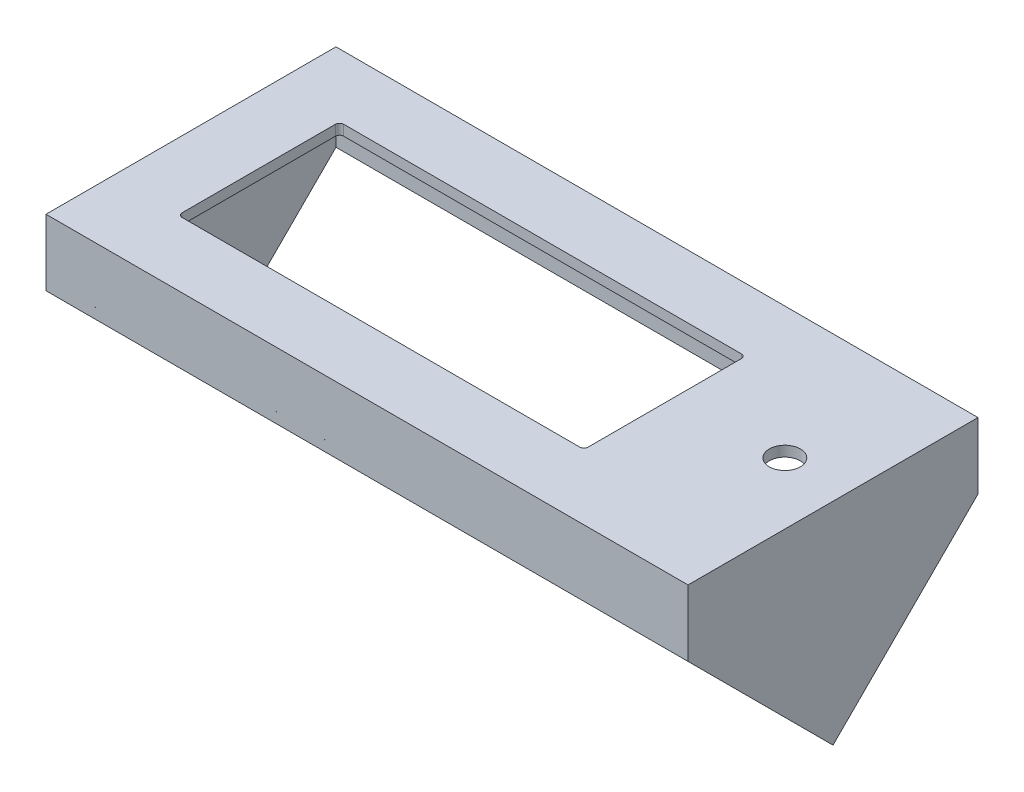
ISO-10303-21;
HEADER;
FILE_DESCRIPTION(('STEP AP214'),'2;1');
FILE_NAME('part.step','',(''),(''),'','','');
FILE_SCHEMA(('AUTOMOTIVE_DESIGN { 1 0 10303 214 1 1 1 1 }'));
ENDSEC;
DATA;
#1=APPLICATION_CONTEXT('core data for automotive mechanical design processes');
#2=APPLICATION_PROTOCOL_DEFINITION('international standard','automotive_design',2000,#1);
#3=PRODUCT_CONTEXT('',#1,'mechanical');
#4=PRODUCT('Part','Part','',(#3));
#5=PRODUCT_RELATED_PRODUCT_CATEGORY('part','',(#4));
#6=PRODUCT_DEFINITION_FORMATION('','',#4);
#7=PRODUCT_DEFINITION_CONTEXT('part definition',#1,'design');
#8=PRODUCT_DEFINITION('design','',#6,#7);
#9=PRODUCT_DEFINITION_SHAPE('','',#8);
#10=(LENGTH_UNIT() NAMED_UNIT(*) SI_UNIT(.MILLI.,.METRE.));
#11=(NAMED_UNIT(*) PLANE_ANGLE_UNIT() SI_UNIT($,.RADIAN.));
#12=(NAMED_UNIT(*) SI_UNIT($,.STERADIAN.) SOLID_ANGLE_UNIT());
#13=UNCERTAINTY_MEASURE_WITH_UNIT(LENGTH_MEASURE(1.E-05),#10,'distance_accuracy_value','');
#14=(GEOMETRIC_REPRESENTATION_CONTEXT(3) GLOBAL_UNCERTAINTY_ASSIGNED_CONTEXT((#13)) GLOBAL_UNIT_ASSIGNED_CONTEXT((#10,
#11,#12)) REPRESENTATION_CONTEXT('',''));
#15=CARTESIAN_POINT('',(0.,0.,0.));
#16=DIRECTION('',(0.,0.,1.));
#17=DIRECTION('',(1.,0.,0.));
#18=AXIS2_PLACEMENT_3D('',#15,#16,#17);
#19=CARTESIAN_POINT('',(-95.0308641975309,-13.5,-32.2993827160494));
#20=DIRECTION('',(-1.,0.,0.));
#21=DIRECTION('',(0.,0.,1.));
#22=AXIS2_PLACEMENT_3D('',#19,#20,#21);
#23=PLANE('',#22);
#24=DIRECTION('',(0.,0.707106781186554,-0.707106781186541));
#25=VECTOR('',#24,1.);
#26=CARTESIAN_POINT('',(-95.0308641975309,-48.5,0.200617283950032));
#27=LINE('',#26,#25);
#28=CARTESIAN_POINT('',(-95.0308641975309,-47.2484209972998,-1.05096171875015));
#29=VERTEX_POINT('',#28);
#30=CARTESIAN_POINT('',(-95.0308641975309,-16.,-32.2993827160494));
#31=VERTEX_POINT('',#30);
#32=EDGE_CURVE('E191',#29,#31,#27,.T.);
#33=ORIENTED_EDGE('',*,*,#32,.T.);
#34=DIRECTION('',(0.,1.,0.));
#35=VECTOR('',#34,1.);
#36=CARTESIAN_POINT('',(-95.0308641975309,-13.5,-32.2993827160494));
#37=LINE('',#36,#35);
#38=CARTESIAN_POINT('',(-95.0308641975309,0.,-32.2993827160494));
#39=VERTEX_POINT('',#38);
#40=EDGE_CURVE('E61',#31,#39,#37,.T.);
#41=ORIENTED_EDGE('',*,*,#40,.T.);
#42=DIRECTION('',(0.,0.,1.));
#43=VECTOR('',#42,1.);
#44=CARTESIAN_POINT('',(-95.0308641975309,0.,-32.2993827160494));
#45=LINE('',#44,#43);
#46=CARTESIAN_POINT('',(-95.0308641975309,0.,32.7006172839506));
#47=VERTEX_POINT('',#46);
#48=EDGE_CURVE('E45',#39,#47,#45,.T.);
#49=ORIENTED_EDGE('',*,*,#48,.T.);
#50=DIRECTION('',(0.,1.,0.));
#51=VECTOR('',#50,1.);
#52=CARTESIAN_POINT('',(-95.0308641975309,-13.5,32.7006172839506));
#53=LINE('',#52,#51);
#54=CARTESIAN_POINT('',(-95.0308641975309,-13.5,32.7006172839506));
#55=VERTEX_POINT('',#54);
#56=EDGE_CURVE('E177',#55,#47,#53,.T.);
#57=ORIENTED_EDGE('',*,*,#56,.F.);
#58=DIRECTION('',(0.,0.707073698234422,0.707139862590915));
#59=VECTOR('',#58,1.);
#60=CARTESIAN_POINT('',(-95.0308641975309,-47.2484209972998,-1.05096171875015));
#61=LINE('',#60,#59);
#62=EDGE_CURVE('E172',#29,#55,#61,.T.);
#63=ORIENTED_EDGE('',*,*,#62,.F.);
#64=EDGE_LOOP('',(#33,#41,#49,#57,#63));
#65=FACE_BOUND('',#64,.T.);
#66=ADVANCED_FACE('F36',(#65),#23,.F.);
#67=CARTESIAN_POINT('',(54.9691358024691,-13.5,-32.2993827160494));
#68=DIRECTION('',(1.,0.,0.));
#69=DIRECTION('',(0.,0.,-1.));
#70=AXIS2_PLACEMENT_3D('',#67,#68,#69);
#71=PLANE('',#70);
#72=DIRECTION('',(0.,1.,0.));
#73=VECTOR('',#72,1.);
#74=CARTESIAN_POINT('',(54.9691358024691,-13.5,-32.2993827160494));
#75=LINE('',#74,#73);
#76=CARTESIAN_POINT('',(54.9691358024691,-16.,-32.2993827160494));
#77=VERTEX_POINT('',#76);
#78=CARTESIAN_POINT('',(54.9691358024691,0.,-32.2993827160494));
#79=VERTEX_POINT('',#78);
#80=EDGE_CURVE('E53',#77,#79,#75,.T.);
#81=ORIENTED_EDGE('',*,*,#80,.F.);
#82=DIRECTION('',(0.,0.707106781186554,-0.707106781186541));
#83=VECTOR('',#82,1.);
#84=CARTESIAN_POINT('',(54.9691358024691,-48.5,0.200617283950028));
#85=LINE('',#84,#83);
#86=CARTESIAN_POINT('',(54.9691358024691,-47.2484209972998,-1.05096171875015));
#87=VERTEX_POINT('',#86);
#88=EDGE_CURVE('E183',#87,#77,#85,.T.);
#89=ORIENTED_EDGE('',*,*,#88,.F.);
#90=DIRECTION('',(0.,0.707073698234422,0.707139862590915));
#91=VECTOR('',#90,1.);
#92=CARTESIAN_POINT('',(54.9691358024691,-47.2484209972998,-1.05096171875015));
#93=LINE('',#92,#91);
#94=CARTESIAN_POINT('',(54.9691358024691,-13.5,32.7006172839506));
#95=VERTEX_POINT('',#94);
#96=EDGE_CURVE('E170',#87,#95,#93,.T.);
#97=ORIENTED_EDGE('',*,*,#96,.T.);
#98=DIRECTION('',(0.,1.,0.));
#99=VECTOR('',#98,1.);
#100=CARTESIAN_POINT('',(54.9691358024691,-13.5,32.7006172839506));
#101=LINE('',#100,#99);
#102=CARTESIAN_POINT('',(54.9691358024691,0.,32.7006172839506));
#103=VERTEX_POINT('',#102);
#104=EDGE_CURVE('E182',#95,#103,#101,.T.);
#105=ORIENTED_EDGE('',*,*,#104,.T.);
#106=DIRECTION('',(0.,0.,-1.));
#107=VECTOR('',#106,1.);
#108=CARTESIAN_POINT('',(54.9691358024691,0.,-32.2993827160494));
#109=LINE('',#108,#107);
#110=EDGE_CURVE('E349',#103,#79,#109,.T.);
#111=ORIENTED_EDGE('',*,*,#110,.T.);
#112=EDGE_LOOP('',(#81,#89,#97,#105,#111));
#113=FACE_BOUND('',#112,.T.);
#114=ADVANCED_FACE('F181',(#113),#71,.F.);
#115=CARTESIAN_POINT('',(0.,2.5,0.));
#116=DIRECTION('',(0.,-1.,0.));
#117=DIRECTION('',(0.,0.,-1.));
#118=AXIS2_PLACEMENT_3D('',#115,#116,#117);
#119=PLANE('',#118);
#120=CARTESIAN_POINT('',(42.5891358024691,2.5,-3.04938271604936));
#121=DIRECTION('',(0.,1.,0.));
#122=DIRECTION('',(0.,0.,1.));
#123=AXIS2_PLACEMENT_3D('',#120,#121,#122);
#124=CIRCLE('',#123,3.75000000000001);
#125=CARTESIAN_POINT('',(42.5891358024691,2.5,0.700617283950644));
#126=VERTEX_POINT('',#125);
#127=EDGE_CURVE('E237',#126,#126,#124,.T.);
#128=ORIENTED_EDGE('',*,*,#127,.F.);
#129=EDGE_LOOP('',(#128));
#130=FACE_BOUND('',#129,.T.);
#131=DIRECTION('',(-1.,0.,0.));
#132=VECTOR('',#131,1.);
#133=CARTESIAN_POINT('',(-80.4108641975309,2.5,-19.5493827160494));
#134=LINE('',#133,#132);
#135=CARTESIAN_POINT('',(15.5891358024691,2.5,-19.5493827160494));
#136=VERTEX_POINT('',#135);
#137=CARTESIAN_POINT('',(-80.4108641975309,2.5,-19.5493827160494));
#138=VERTEX_POINT('',#137);
#139=EDGE_CURVE('E327',#136,#138,#134,.T.);
#140=ORIENTED_EDGE('',*,*,#139,.F.);
#141=CARTESIAN_POINT('',(15.5891358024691,2.5,-18.5493827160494));
#142=DIRECTION('',(0.,1.,0.));
#143=DIRECTION('',(0.,0.,-1.));
#144=AXIS2_PLACEMENT_3D('',#141,#142,#143);
#145=CIRCLE('',#144,1.);
#146=CARTESIAN_POINT('',(16.5891358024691,2.5,-18.5493827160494));
#147=VERTEX_POINT('',#146);
#148=EDGE_CURVE('E297',#147,#136,#145,.T.);
#149=ORIENTED_EDGE('',*,*,#148,.F.);
#150=DIRECTION('',(0.,0.,-1.));
#151=VECTOR('',#150,1.);
#152=CARTESIAN_POINT('',(16.5891358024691,2.5,-18.5493827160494));
#153=LINE('',#152,#151);
#154=CARTESIAN_POINT('',(16.5891358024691,2.5,18.4506172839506));
#155=VERTEX_POINT('',#154);
#156=EDGE_CURVE('E304',#155,#147,#153,.T.);
#157=ORIENTED_EDGE('',*,*,#156,.F.);
#158=CARTESIAN_POINT('',(15.5891358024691,2.5,18.4506172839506));
#159=DIRECTION('',(0.,1.,0.));
#160=DIRECTION('',(0.,0.,1.));
#161=AXIS2_PLACEMENT_3D('',#158,#159,#160);
#162=CIRCLE('',#161,1.);
#163=CARTESIAN_POINT('',(15.5891358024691,2.5,19.4506172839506));
#164=VERTEX_POINT('',#163);
#165=EDGE_CURVE('E342',#164,#155,#162,.T.);
#166=ORIENTED_EDGE('',*,*,#165,.F.);
#167=DIRECTION('',(1.,0.,0.));
#168=VECTOR('',#167,1.);
#169=CARTESIAN_POINT('',(-80.4108641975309,2.5,19.4506172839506));
#170=LINE('',#169,#168);
#171=CARTESIAN_POINT('',(-80.4108641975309,2.5,19.4506172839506));
#172=VERTEX_POINT('',#171);
#173=EDGE_CURVE('E339',#172,#164,#170,.T.);
#174=ORIENTED_EDGE('',*,*,#173,.F.);
#175=CARTESIAN_POINT('',(-80.4108641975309,2.5,18.4506172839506));
#176=DIRECTION('',(0.,1.,0.));
#177=DIRECTION('',(0.,0.,1.));
#178=AXIS2_PLACEMENT_3D('',#175,#176,#177);
#179=CIRCLE('',#178,1.);
#180=CARTESIAN_POINT('',(-81.4108641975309,2.5,18.4506172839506));
#181=VERTEX_POINT('',#180);
#182=EDGE_CURVE('E336',#181,#172,#179,.T.);
#183=ORIENTED_EDGE('',*,*,#182,.F.);
#184=DIRECTION('',(0.,0.,1.));
#185=VECTOR('',#184,1.);
#186=CARTESIAN_POINT('',(-81.4108641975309,2.5,-18.5493827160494));
#187=LINE('',#186,#185);
#188=CARTESIAN_POINT('',(-81.4108641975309,2.5,-18.5493827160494));
#189=VERTEX_POINT('',#188);
#190=EDGE_CURVE('E333',#189,#181,#187,.T.);
#191=ORIENTED_EDGE('',*,*,#190,.F.);
#192=CARTESIAN_POINT('',(-80.4108641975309,2.5,-18.5493827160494));
#193=DIRECTION('',(0.,1.,0.));
#194=DIRECTION('',(0.,0.,-1.));
#195=AXIS2_PLACEMENT_3D('',#192,#193,#194);
#196=CIRCLE('',#195,1.);
#197=EDGE_CURVE('E330',#138,#189,#196,.T.);
#198=ORIENTED_EDGE('',*,*,#197,.F.);
#199=EDGE_LOOP('',(#140,#149,#157,#166,#174,#183,#191,#198));
#200=FACE_BOUND('',#199,.T.);
#201=DIRECTION('',(0.,0.,-1.));
#202=VECTOR('',#201,1.);
#203=CARTESIAN_POINT('',(57.4691358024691,2.5,-34.7993827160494));
#204=LINE('',#203,#202);
#205=CARTESIAN_POINT('',(57.4691358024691,2.5,35.2006172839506));
#206=VERTEX_POINT('',#205);
#207=CARTESIAN_POINT('',(57.4691358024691,2.5,-34.7993827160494));
#208=VERTEX_POINT('',#207);
#209=EDGE_CURVE('E223',#206,#208,#204,.T.);
#210=ORIENTED_EDGE('',*,*,#209,.T.);
#211=DIRECTION('',(-1.,0.,0.));
#212=VECTOR('',#211,1.);
#213=CARTESIAN_POINT('',(-97.5308641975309,2.5,-34.7993827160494));
#214=LINE('',#213,#212);
#215=CARTESIAN_POINT('',(-97.5308641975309,2.5,-34.7993827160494));
#216=VERTEX_POINT('',#215);
#217=EDGE_CURVE('E286',#208,#216,#214,.T.);
#218=ORIENTED_EDGE('',*,*,#217,.T.);
#219=DIRECTION('',(0.,0.,1.));
#220=VECTOR('',#219,1.);
#221=CARTESIAN_POINT('',(-97.5308641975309,2.5,-34.7993827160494));
#222=LINE('',#221,#220);
#223=CARTESIAN_POINT('',(-97.5308641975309,2.5,35.2006172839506));
#224=VERTEX_POINT('',#223);
#225=EDGE_CURVE('E288',#216,#224,#222,.T.);
#226=ORIENTED_EDGE('',*,*,#225,.T.);
#227=DIRECTION('',(1.,0.,0.));
#228=VECTOR('',#227,1.);
#229=CARTESIAN_POINT('',(-97.5308641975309,2.5,35.2006172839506));
#230=LINE('',#229,#228);
#231=EDGE_CURVE('E216',#224,#206,#230,.T.);
#232=ORIENTED_EDGE('',*,*,#231,.T.);
#233=EDGE_LOOP('',(#210,#218,#226,#232));
#234=FACE_BOUND('',#233,.T.);
#235=ADVANCED_FACE('F290',(#130,#200,#234),#119,.F.);
#236=CARTESIAN_POINT('',(0.,0.,0.));
#237=DIRECTION('',(0.,-1.,0.));
#238=DIRECTION('',(0.,0.,-1.));
#239=AXIS2_PLACEMENT_3D('',#236,#237,#238);
#240=PLANE('',#239);
#241=CARTESIAN_POINT('',(42.5891358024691,0.,-3.04938271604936));
#242=DIRECTION('',(0.,1.,0.));
#243=DIRECTION('',(0.,0.,1.));
#244=AXIS2_PLACEMENT_3D('',#241,#242,#243);
#245=CIRCLE('',#244,3.75000000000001);
#246=CARTESIAN_POINT('',(42.5891358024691,0.,0.700617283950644));
#247=VERTEX_POINT('',#246);
#248=EDGE_CURVE('E294',#247,#247,#245,.T.);
#249=ORIENTED_EDGE('',*,*,#248,.T.);
#250=EDGE_LOOP('',(#249));
#251=FACE_BOUND('',#250,.T.);
#252=CARTESIAN_POINT('',(15.5891358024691,0.,-18.5493827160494));
#253=DIRECTION('',(0.,1.,0.));
#254=DIRECTION('',(0.,0.,-1.));
#255=AXIS2_PLACEMENT_3D('',#252,#253,#254);
#256=CIRCLE('',#255,1.);
#257=CARTESIAN_POINT('',(16.5891358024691,0.,-18.5493827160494));
#258=VERTEX_POINT('',#257);
#259=CARTESIAN_POINT('',(15.5891358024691,0.,-19.5493827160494));
#260=VERTEX_POINT('',#259);
#261=EDGE_CURVE('E300',#258,#260,#256,.T.);
#262=ORIENTED_EDGE('',*,*,#261,.T.);
#263=DIRECTION('',(-1.,0.,0.));
#264=VECTOR('',#263,1.);
#265=CARTESIAN_POINT('',(-80.4108641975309,0.,-19.5493827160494));
#266=LINE('',#265,#264);
#267=CARTESIAN_POINT('',(-80.4108641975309,0.,-19.5493827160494));
#268=VERTEX_POINT('',#267);
#269=EDGE_CURVE('E303',#260,#268,#266,.T.);
#270=ORIENTED_EDGE('',*,*,#269,.T.);
#271=CARTESIAN_POINT('',(-80.4108641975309,0.,-18.5493827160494));
#272=DIRECTION('',(0.,1.,0.));
#273=DIRECTION('',(0.,0.,-1.));
#274=AXIS2_PLACEMENT_3D('',#271,#272,#273);
#275=CIRCLE('',#274,1.);
#276=CARTESIAN_POINT('',(-81.4108641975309,0.,-18.5493827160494));
#277=VERTEX_POINT('',#276);
#278=EDGE_CURVE('E307',#268,#277,#275,.T.);
#279=ORIENTED_EDGE('',*,*,#278,.T.);
#280=DIRECTION('',(0.,0.,1.));
#281=VECTOR('',#280,1.);
#282=CARTESIAN_POINT('',(-81.4108641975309,0.,-18.5493827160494));
#283=LINE('',#282,#281);
#284=CARTESIAN_POINT('',(-81.4108641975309,0.,18.4506172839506));
#285=VERTEX_POINT('',#284);
#286=EDGE_CURVE('E310',#277,#285,#283,.T.);
#287=ORIENTED_EDGE('',*,*,#286,.T.);
#288=CARTESIAN_POINT('',(-80.4108641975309,0.,18.4506172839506));
#289=DIRECTION('',(0.,1.,0.));
#290=DIRECTION('',(0.,0.,1.));
#291=AXIS2_PLACEMENT_3D('',#288,#289,#290);
#292=CIRCLE('',#291,1.);
#293=CARTESIAN_POINT('',(-80.4108641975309,0.,19.4506172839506));
#294=VERTEX_POINT('',#293);
#295=EDGE_CURVE('E313',#285,#294,#292,.T.);
#296=ORIENTED_EDGE('',*,*,#295,.T.);
#297=DIRECTION('',(1.,0.,0.));
#298=VECTOR('',#297,1.);
#299=CARTESIAN_POINT('',(-80.4108641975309,0.,19.4506172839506));
#300=LINE('',#299,#298);
#301=CARTESIAN_POINT('',(15.5891358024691,0.,19.4506172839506));
#302=VERTEX_POINT('',#301);
#303=EDGE_CURVE('E316',#294,#302,#300,.T.);
#304=ORIENTED_EDGE('',*,*,#303,.T.);
#305=CARTESIAN_POINT('',(15.5891358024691,0.,18.4506172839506));
#306=DIRECTION('',(0.,1.,0.));
#307=DIRECTION('',(0.,0.,1.));
#308=AXIS2_PLACEMENT_3D('',#305,#306,#307);
#309=CIRCLE('',#308,1.);
#310=CARTESIAN_POINT('',(16.5891358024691,0.,18.4506172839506));
#311=VERTEX_POINT('',#310);
#312=EDGE_CURVE('E319',#302,#311,#309,.T.);
#313=ORIENTED_EDGE('',*,*,#312,.T.);
#314=DIRECTION('',(0.,0.,-1.));
#315=VECTOR('',#314,1.);
#316=CARTESIAN_POINT('',(16.5891358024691,0.,-18.5493827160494));
#317=LINE('',#316,#315);
#318=EDGE_CURVE('E322',#311,#258,#317,.T.);
#319=ORIENTED_EDGE('',*,*,#318,.T.);
#320=EDGE_LOOP('',(#262,#270,#279,#287,#296,#304,#313,#319));
#321=FACE_BOUND('',#320,.T.);
#322=ORIENTED_EDGE('',*,*,#110,.F.);
#323=DIRECTION('',(1.,0.,0.));
#324=VECTOR('',#323,1.);
#325=CARTESIAN_POINT('',(54.9691358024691,0.,32.7006172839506));
#326=LINE('',#325,#324);
#327=EDGE_CURVE('E12',#47,#103,#326,.T.);
#328=ORIENTED_EDGE('',*,*,#327,.F.);
#329=ORIENTED_EDGE('',*,*,#48,.F.);
#330=DIRECTION('',(-1.,0.,0.));
#331=VECTOR('',#330,1.);
#332=CARTESIAN_POINT('',(54.9691358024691,0.,-32.2993827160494));
#333=LINE('',#332,#331);
#334=EDGE_CURVE('E365',#79,#39,#333,.T.);
#335=ORIENTED_EDGE('',*,*,#334,.F.);
#336=EDGE_LOOP('',(#322,#328,#329,#335));
#337=FACE_BOUND('',#336,.T.);
#338=ADVANCED_FACE('F38',(#251,#321,#337),#240,.T.);
#339=CARTESIAN_POINT('',(15.5891358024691,0.,-18.5493827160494));
#340=DIRECTION('',(0.,1.,0.));
#341=DIRECTION('',(0.,0.,1.));
#342=AXIS2_PLACEMENT_3D('',#339,#340,#341);
#343=CYLINDRICAL_SURFACE('',#342,1.);
#344=ORIENTED_EDGE('',*,*,#148,.T.);
#345=DIRECTION('',(0.,1.,0.));
#346=VECTOR('',#345,1.);
#347=CARTESIAN_POINT('',(15.5891358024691,0.,-19.5493827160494));
#348=LINE('',#347,#346);
#349=EDGE_CURVE('E325',#260,#136,#348,.T.);
#350=ORIENTED_EDGE('',*,*,#349,.F.);
#351=ORIENTED_EDGE('',*,*,#261,.F.);
#352=DIRECTION('',(0.,1.,0.));
#353=VECTOR('',#352,1.);
#354=CARTESIAN_POINT('',(16.5891358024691,0.,-18.5493827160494));
#355=LINE('',#354,#353);
#356=EDGE_CURVE('E347',#258,#147,#355,.T.);
#357=ORIENTED_EDGE('',*,*,#356,.T.);
#358=EDGE_LOOP('',(#344,#350,#351,#357));
#359=FACE_BOUND('',#358,.T.);
#360=ADVANCED_FACE('F418',(#359),#343,.F.);
#361=CARTESIAN_POINT('',(16.5891358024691,0.,-18.5493827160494));
#362=DIRECTION('',(1.,0.,0.));
#363=DIRECTION('',(0.,0.,-1.));
#364=AXIS2_PLACEMENT_3D('',#361,#362,#363);
#365=PLANE('',#364);
#366=ORIENTED_EDGE('',*,*,#156,.T.);
#367=ORIENTED_EDGE('',*,*,#356,.F.);
#368=ORIENTED_EDGE('',*,*,#318,.F.);
#369=DIRECTION('',(0.,1.,0.));
#370=VECTOR('',#369,1.);
#371=CARTESIAN_POINT('',(16.5891358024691,0.,18.4506172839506));
#372=LINE('',#371,#370);
#373=EDGE_CURVE('E350',#311,#155,#372,.T.);
#374=ORIENTED_EDGE('',*,*,#373,.T.);
#375=EDGE_LOOP('',(#366,#367,#368,#374));
#376=FACE_BOUND('',#375,.T.);
#377=ADVANCED_FACE('F414',(#376),#365,.F.);
#378=CARTESIAN_POINT('',(15.5891358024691,0.,18.4506172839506));
#379=DIRECTION('',(0.,1.,0.));
#380=DIRECTION('',(0.,0.,1.));
#381=AXIS2_PLACEMENT_3D('',#378,#379,#380);
#382=CYLINDRICAL_SURFACE('',#381,1.);
#383=ORIENTED_EDGE('',*,*,#165,.T.);
#384=ORIENTED_EDGE('',*,*,#373,.F.);
#385=ORIENTED_EDGE('',*,*,#312,.F.);
#386=DIRECTION('',(0.,1.,0.));
#387=VECTOR('',#386,1.);
#388=CARTESIAN_POINT('',(15.5891358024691,0.,19.4506172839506));
#389=LINE('',#388,#387);
#390=EDGE_CURVE('E352',#302,#164,#389,.T.);
#391=ORIENTED_EDGE('',*,*,#390,.T.);
#392=EDGE_LOOP('',(#383,#384,#385,#391));
#393=FACE_BOUND('',#392,.T.);
#394=ADVANCED_FACE('F417',(#393),#382,.F.);
#395=CARTESIAN_POINT('',(-80.4108641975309,0.,19.4506172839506));
#396=DIRECTION('',(0.,0.,1.));
#397=DIRECTION('',(1.,0.,0.));
#398=AXIS2_PLACEMENT_3D('',#395,#396,#397);
#399=PLANE('',#398);
#400=ORIENTED_EDGE('',*,*,#173,.T.);
#401=ORIENTED_EDGE('',*,*,#390,.F.);
#402=ORIENTED_EDGE('',*,*,#303,.F.);
#403=DIRECTION('',(0.,1.,0.));
#404=VECTOR('',#403,1.);
#405=CARTESIAN_POINT('',(-80.4108641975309,0.,19.4506172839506));
#406=LINE('',#405,#404);
#407=EDGE_CURVE('E354',#294,#172,#406,.T.);
#408=ORIENTED_EDGE('',*,*,#407,.T.);
#409=EDGE_LOOP('',(#400,#401,#402,#408));
#410=FACE_BOUND('',#409,.T.);
#411=ADVANCED_FACE('F422',(#410),#399,.F.);
#412=CARTESIAN_POINT('',(-80.4108641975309,0.,18.4506172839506));
#413=DIRECTION('',(0.,1.,0.));
#414=DIRECTION('',(0.,0.,1.));
#415=AXIS2_PLACEMENT_3D('',#412,#413,#414);
#416=CYLINDRICAL_SURFACE('',#415,1.);
#417=ORIENTED_EDGE('',*,*,#182,.T.);
#418=ORIENTED_EDGE('',*,*,#407,.F.);
#419=ORIENTED_EDGE('',*,*,#295,.F.);
#420=DIRECTION('',(0.,1.,0.));
#421=VECTOR('',#420,1.);
#422=CARTESIAN_POINT('',(-81.4108641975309,0.,18.4506172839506));
#423=LINE('',#422,#421);
#424=EDGE_CURVE('E356',#285,#181,#423,.T.);
#425=ORIENTED_EDGE('',*,*,#424,.T.);
#426=EDGE_LOOP('',(#417,#418,#419,#425));
#427=FACE_BOUND('',#426,.T.);
#428=ADVANCED_FACE('F426',(#427),#416,.F.);
#429=CARTESIAN_POINT('',(-81.4108641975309,0.,-18.5493827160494));
#430=DIRECTION('',(-1.,0.,0.));
#431=DIRECTION('',(0.,0.,1.));
#432=AXIS2_PLACEMENT_3D('',#429,#430,#431);
#433=PLANE('',#432);
#434=ORIENTED_EDGE('',*,*,#190,.T.);
#435=ORIENTED_EDGE('',*,*,#424,.F.);
#436=ORIENTED_EDGE('',*,*,#286,.F.);
#437=DIRECTION('',(0.,1.,0.));
#438=VECTOR('',#437,1.);
#439=CARTESIAN_POINT('',(-81.4108641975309,0.,-18.5493827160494));
#440=LINE('',#439,#438);
#441=EDGE_CURVE('E358',#277,#189,#440,.T.);
#442=ORIENTED_EDGE('',*,*,#441,.T.);
#443=EDGE_LOOP('',(#434,#435,#436,#442));
#444=FACE_BOUND('',#443,.T.);
#445=ADVANCED_FACE('F430',(#444),#433,.F.);
#446=CARTESIAN_POINT('',(-80.4108641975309,0.,-18.5493827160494));
#447=DIRECTION('',(0.,1.,0.));
#448=DIRECTION('',(0.,0.,1.));
#449=AXIS2_PLACEMENT_3D('',#446,#447,#448);
#450=CYLINDRICAL_SURFACE('',#449,1.);
#451=ORIENTED_EDGE('',*,*,#197,.T.);
#452=ORIENTED_EDGE('',*,*,#441,.F.);
#453=ORIENTED_EDGE('',*,*,#278,.F.);
#454=DIRECTION('',(0.,1.,0.));
#455=VECTOR('',#454,1.);
#456=CARTESIAN_POINT('',(-80.4108641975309,0.,-19.5493827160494));
#457=LINE('',#456,#455);
#458=EDGE_CURVE('E360',#268,#138,#457,.T.);
#459=ORIENTED_EDGE('',*,*,#458,.T.);
#460=EDGE_LOOP('',(#451,#452,#453,#459));
#461=FACE_BOUND('',#460,.T.);
#462=ADVANCED_FACE('F434',(#461),#450,.F.);
#463=CARTESIAN_POINT('',(-80.4108641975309,0.,-19.5493827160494));
#464=DIRECTION('',(0.,0.,-1.));
#465=DIRECTION('',(-1.,0.,0.));
#466=AXIS2_PLACEMENT_3D('',#463,#464,#465);
#467=PLANE('',#466);
#468=ORIENTED_EDGE('',*,*,#139,.T.);
#469=ORIENTED_EDGE('',*,*,#458,.F.);
#470=ORIENTED_EDGE('',*,*,#269,.F.);
#471=ORIENTED_EDGE('',*,*,#349,.T.);
#472=EDGE_LOOP('',(#468,#469,#470,#471));
#473=FACE_BOUND('',#472,.T.);
#474=ADVANCED_FACE('F412',(#473),#467,.F.);
#475=CARTESIAN_POINT('',(42.5891358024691,0.,-3.04938271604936));
#476=DIRECTION('',(0.,1.,0.));
#477=DIRECTION('',(0.,0.,1.));
#478=AXIS2_PLACEMENT_3D('',#475,#476,#477);
#479=CYLINDRICAL_SURFACE('',#478,3.75000000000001);
#480=ORIENTED_EDGE('',*,*,#248,.F.);
#481=EDGE_LOOP('',(#480));
#482=FACE_BOUND('',#481,.T.);
#483=ORIENTED_EDGE('',*,*,#127,.T.);
#484=EDGE_LOOP('',(#483));
#485=FACE_BOUND('',#484,.T.);
#486=ADVANCED_FACE('F409',(#482,#485),#479,.F.);
#487=CARTESIAN_POINT('',(57.4691358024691,-13.5,-34.7993827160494));
#488=DIRECTION('',(1.,0.,0.));
#489=DIRECTION('',(0.,0.,-1.));
#490=AXIS2_PLACEMENT_3D('',#487,#488,#489);
#491=PLANE('',#490);
#492=ORIENTED_EDGE('',*,*,#209,.F.);
#493=DIRECTION('',(0.,1.,0.));
#494=VECTOR('',#493,1.);
#495=CARTESIAN_POINT('',(57.4691358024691,-13.5,35.2006172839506));
#496=LINE('',#495,#494);
#497=CARTESIAN_POINT('',(57.4691358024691,-13.5,35.2006172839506));
#498=VERTEX_POINT('',#497);
#499=EDGE_CURVE('E233',#498,#206,#496,.T.);
#500=ORIENTED_EDGE('',*,*,#499,.F.);
#501=DIRECTION('',(0.,-0.707106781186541,-0.707106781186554));
#502=VECTOR('',#501,1.);
#503=CARTESIAN_POINT('',(57.4691358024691,-13.5,35.2006172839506));
#504=LINE('',#503,#502);
#505=CARTESIAN_POINT('',(57.4691358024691,-48.5,0.200617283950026));
#506=VERTEX_POINT('',#505);
#507=EDGE_CURVE('E184',#498,#506,#504,.T.);
#508=ORIENTED_EDGE('',*,*,#507,.T.);
#509=DIRECTION('',(0.,0.707106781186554,-0.707106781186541));
#510=VECTOR('',#509,1.);
#511=CARTESIAN_POINT('',(57.4691358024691,-48.5,0.200617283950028));
#512=LINE('',#511,#510);
#513=CARTESIAN_POINT('',(57.4691358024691,-13.5,-34.7993827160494));
#514=VERTEX_POINT('',#513);
#515=EDGE_CURVE('E196',#506,#514,#512,.T.);
#516=ORIENTED_EDGE('',*,*,#515,.T.);
#517=DIRECTION('',(0.,1.,0.));
#518=VECTOR('',#517,1.);
#519=CARTESIAN_POINT('',(57.4691358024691,-13.5,-34.7993827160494));
#520=LINE('',#519,#518);
#521=EDGE_CURVE('E229',#514,#208,#520,.T.);
#522=ORIENTED_EDGE('',*,*,#521,.T.);
#523=EDGE_LOOP('',(#492,#500,#508,#516,#522));
#524=FACE_BOUND('',#523,.T.);
#525=ADVANCED_FACE('F255',(#524),#491,.T.);
#526=CARTESIAN_POINT('',(-97.5308641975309,-13.5,35.2006172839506));
#527=DIRECTION('',(0.,0.,1.));
#528=DIRECTION('',(1.,0.,0.));
#529=AXIS2_PLACEMENT_3D('',#526,#527,#528);
#530=PLANE('',#529);
#531=ORIENTED_EDGE('',*,*,#231,.F.);
#532=DIRECTION('',(0.,1.,0.));
#533=VECTOR('',#532,1.);
#534=CARTESIAN_POINT('',(-97.5308641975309,-13.5,35.2006172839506));
#535=LINE('',#534,#533);
#536=CARTESIAN_POINT('',(-97.5308641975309,-13.5,35.2006172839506));
#537=VERTEX_POINT('',#536);
#538=EDGE_CURVE('E228',#537,#224,#535,.T.);
#539=ORIENTED_EDGE('',*,*,#538,.F.);
#540=DIRECTION('',(1.,0.,0.));
#541=VECTOR('',#540,1.);
#542=CARTESIAN_POINT('',(-97.5308641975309,-13.5,35.2006172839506));
#543=LINE('',#542,#541);
#544=EDGE_CURVE('E215',#537,#498,#543,.T.);
#545=ORIENTED_EDGE('',*,*,#544,.T.);
#546=ORIENTED_EDGE('',*,*,#499,.T.);
#547=EDGE_LOOP('',(#531,#539,#545,#546));
#548=FACE_BOUND('',#547,.T.);
#549=ADVANCED_FACE('F249',(#548),#530,.T.);
#550=CARTESIAN_POINT('',(-97.5308641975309,-13.5,-34.7993827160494));
#551=DIRECTION('',(-1.,0.,0.));
#552=DIRECTION('',(0.,0.,1.));
#553=AXIS2_PLACEMENT_3D('',#550,#551,#552);
#554=PLANE('',#553);
#555=ORIENTED_EDGE('',*,*,#225,.F.);
#556=DIRECTION('',(0.,1.,0.));
#557=VECTOR('',#556,1.);
#558=CARTESIAN_POINT('',(-97.5308641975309,-13.5,-34.7993827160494));
#559=LINE('',#558,#557);
#560=CARTESIAN_POINT('',(-97.5308641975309,-13.5,-34.7993827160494));
#561=VERTEX_POINT('',#560);
#562=EDGE_CURVE('E226',#561,#216,#559,.T.);
#563=ORIENTED_EDGE('',*,*,#562,.F.);
#564=DIRECTION('',(0.,0.707106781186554,-0.707106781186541));
#565=VECTOR('',#564,1.);
#566=CARTESIAN_POINT('',(-97.5308641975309,-48.5,0.200617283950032));
#567=LINE('',#566,#565);
#568=CARTESIAN_POINT('',(-97.5308641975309,-48.5,0.200617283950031));
#569=VERTEX_POINT('',#568);
#570=EDGE_CURVE('E205',#569,#561,#567,.T.);
#571=ORIENTED_EDGE('',*,*,#570,.F.);
#572=DIRECTION('',(0.,-0.707106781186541,-0.707106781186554));
#573=VECTOR('',#572,1.);
#574=CARTESIAN_POINT('',(-97.5308641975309,-13.5,35.2006172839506));
#575=LINE('',#574,#573);
#576=EDGE_CURVE('E178',#537,#569,#575,.T.);
#577=ORIENTED_EDGE('',*,*,#576,.F.);
#578=ORIENTED_EDGE('',*,*,#538,.T.);
#579=EDGE_LOOP('',(#555,#563,#571,#577,#578));
#580=FACE_BOUND('',#579,.T.);
#581=ADVANCED_FACE('F277',(#580),#554,.T.);
#582=CARTESIAN_POINT('',(-97.5308641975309,-13.5,-34.7993827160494));
#583=DIRECTION('',(0.,0.,-1.));
#584=DIRECTION('',(-1.,0.,0.));
#585=AXIS2_PLACEMENT_3D('',#582,#583,#584);
#586=PLANE('',#585);
#587=ORIENTED_EDGE('',*,*,#217,.F.);
#588=ORIENTED_EDGE('',*,*,#521,.F.);
#589=DIRECTION('',(-1.,0.,0.));
#590=VECTOR('',#589,1.);
#591=CARTESIAN_POINT('',(-97.5308641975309,-13.5,-34.7993827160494));
#592=LINE('',#591,#590);
#593=EDGE_CURVE('E213',#514,#561,#592,.T.);
#594=ORIENTED_EDGE('',*,*,#593,.T.);
#595=ORIENTED_EDGE('',*,*,#562,.T.);
#596=EDGE_LOOP('',(#587,#588,#594,#595));
#597=FACE_BOUND('',#596,.T.);
#598=ADVANCED_FACE('F284',(#597),#586,.T.);
#599=CARTESIAN_POINT('',(-95.0308641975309,-13.5,-32.2993827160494));
#600=DIRECTION('',(0.,0.,-1.));
#601=DIRECTION('',(-1.,0.,0.));
#602=AXIS2_PLACEMENT_3D('',#599,#600,#601);
#603=PLANE('',#602);
#604=ORIENTED_EDGE('',*,*,#334,.T.);
#605=ORIENTED_EDGE('',*,*,#40,.F.);
#606=DIRECTION('',(1.,0.,0.));
#607=VECTOR('',#606,1.);
#608=CARTESIAN_POINT('',(-95.0308641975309,-16.,-32.2993827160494));
#609=LINE('',#608,#607);
#610=EDGE_CURVE('E372',#31,#77,#609,.T.);
#611=ORIENTED_EDGE('',*,*,#610,.T.);
#612=ORIENTED_EDGE('',*,*,#80,.T.);
#613=EDGE_LOOP('',(#604,#605,#611,#612));
#614=FACE_BOUND('',#613,.T.);
#615=ADVANCED_FACE('F370',(#614),#603,.F.);
#616=CARTESIAN_POINT('',(-95.0308641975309,-13.5,32.7006172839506));
#617=DIRECTION('',(0.,0.,1.));
#618=DIRECTION('',(1.,0.,0.));
#619=AXIS2_PLACEMENT_3D('',#616,#617,#618);
#620=PLANE('',#619);
#621=ORIENTED_EDGE('',*,*,#327,.T.);
#622=ORIENTED_EDGE('',*,*,#104,.F.);
#623=DIRECTION('',(1.,0.,0.));
#624=VECTOR('',#623,1.);
#625=CARTESIAN_POINT('',(-95.0308641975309,-13.5,32.7006172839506));
#626=LINE('',#625,#624);
#627=EDGE_CURVE('E167',#55,#95,#626,.T.);
#628=ORIENTED_EDGE('',*,*,#627,.F.);
#629=ORIENTED_EDGE('',*,*,#56,.T.);
#630=EDGE_LOOP('',(#621,#622,#628,#629));
#631=FACE_BOUND('',#630,.T.);
#632=ADVANCED_FACE('F186',(#631),#620,.F.);
#633=CARTESIAN_POINT('',(-97.5308641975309,-48.5,0.200617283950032));
#634=DIRECTION('',(0.,-0.707106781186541,-0.707106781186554));
#635=DIRECTION('',(0.,0.707106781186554,-0.707106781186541));
#636=AXIS2_PLACEMENT_3D('',#633,#634,#635);
#637=PLANE('',#636);
#638=ORIENTED_EDGE('',*,*,#88,.T.);
#639=ORIENTED_EDGE('',*,*,#610,.F.);
#640=ORIENTED_EDGE('',*,*,#32,.F.);
#641=DIRECTION('',(-1.,0.,0.));
#642=VECTOR('',#641,1.);
#643=CARTESIAN_POINT('',(54.9691358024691,-47.2484209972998,-1.05096171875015));
#644=LINE('',#643,#642);
#645=EDGE_CURVE('E375',#87,#29,#644,.T.);
#646=ORIENTED_EDGE('',*,*,#645,.F.);
#647=EDGE_LOOP('',(#638,#639,#640,#646));
#648=FACE_BOUND('',#647,.T.);
#649=ORIENTED_EDGE('',*,*,#570,.T.);
#650=ORIENTED_EDGE('',*,*,#593,.F.);
#651=ORIENTED_EDGE('',*,*,#515,.F.);
#652=DIRECTION('',(1.,0.,0.));
#653=VECTOR('',#652,1.);
#654=CARTESIAN_POINT('',(-97.5308641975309,-48.5,0.200617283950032));
#655=LINE('',#654,#653);
#656=EDGE_CURVE('E195',#569,#506,#655,.T.);
#657=ORIENTED_EDGE('',*,*,#656,.F.);
#658=EDGE_LOOP('',(#649,#650,#651,#657));
#659=FACE_BOUND('',#658,.T.);
#660=ADVANCED_FACE('F282',(#648,#659),#637,.T.);
#661=CARTESIAN_POINT('',(-97.5308641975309,-13.5,35.2006172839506));
#662=DIRECTION('',(0.,-0.707106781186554,0.707106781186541));
#663=DIRECTION('',(0.,-0.707106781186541,-0.707106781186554));
#664=AXIS2_PLACEMENT_3D('',#661,#662,#663);
#665=PLANE('',#664);
#666=ORIENTED_EDGE('',*,*,#656,.T.);
#667=ORIENTED_EDGE('',*,*,#507,.F.);
#668=ORIENTED_EDGE('',*,*,#544,.F.);
#669=ORIENTED_EDGE('',*,*,#576,.T.);
#670=EDGE_LOOP('',(#666,#667,#668,#669));
#671=FACE_BOUND('',#670,.T.);
#672=ADVANCED_FACE('F258',(#671),#665,.T.);
#673=CARTESIAN_POINT('',(54.9691358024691,-47.2484209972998,-1.05096171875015));
#674=DIRECTION('',(0.,-0.707139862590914,0.707073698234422));
#675=DIRECTION('',(0.,-0.707073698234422,-0.707139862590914));
#676=AXIS2_PLACEMENT_3D('',#673,#674,#675);
#677=PLANE('',#676);
#678=ORIENTED_EDGE('',*,*,#62,.T.);
#679=ORIENTED_EDGE('',*,*,#627,.T.);
#680=ORIENTED_EDGE('',*,*,#96,.F.);
#681=ORIENTED_EDGE('',*,*,#645,.T.);
#682=EDGE_LOOP('',(#678,#679,#680,#681));
#683=FACE_BOUND('',#682,.T.);
#684=ADVANCED_FACE('F169',(#683),#677,.F.);
#685=CLOSED_SHELL('',(#66,#114,#235,#338,#360,#377,#394,#411,#428,#445,#462,#474,#486,#525,#549,
#581,#598,#615,#632,#660,#672,#684));
#686=MANIFOLD_SOLID_BREP('B2',#685);
#687=ADVANCED_BREP_SHAPE_REPRESENTATION('',(#18,#686),#14);
#688=SHAPE_DEFINITION_REPRESENTATION(#9,#687);
ENDSEC;
END-ISO-10303-21;
